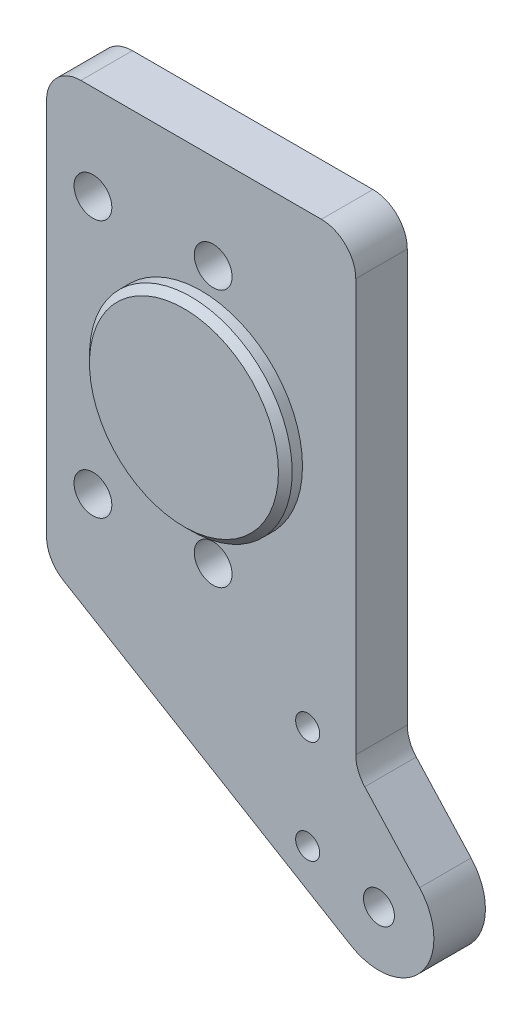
from build123d import *

# Parameters (mm, degrees)
ESQUISSE1_R                     = 29.5
BOSS_EXTRU_1_DEPTH              = 5
BOSS_EXTRU_2_DEPTH              = 15
CHANFREIN1_SIZE                 = 2
ESQUISSE3_R                     = 5.5
ENL_V_MAT_EXTRU_1_DEPTH         = 15
R_P_TITION_LIN_AIRE1_COUNT      = 2
R_P_TITION_LIN_AIRE1_PITCH      = 35
R_P_TITION_LIN_AIRE1_COUNT_DIR2 = 2
R_P_TITION_LIN_AIRE1_PITCH_DIR2 = 75
ESQUISSE4_R                     = 4.5
ENL_V_MAT_EXTRU_2_DEPTH         = 15
ESQUISSE5_R                     = 3.5
ENL_V_MAT_EXTRU_3_DEPTH         = 15
R_P_TITION_LIN_AIRE2_COUNT      = 2
R_P_TITION_LIN_AIRE2_PITCH      = 30
ESQUISSE6_R                     = 29.5
BOSS_EXTRU_3_DEPTH              = 5
CHANFREIN2_SIZE                 = 2
ESQUISSE7_R                     = 29.5
ENL_V_MAT_EXTRU_4_DEPTH         = 5


with BuildPart() as part:
    # Esquisse1 → Boss.-Extru.1 (new body)
    with BuildSketch(Plane.XY):
        Circle(ESQUISSE1_R)
    extrude(amount=BOSS_EXTRU_1_DEPTH)

    # Esquisse2 → Boss.-Extru.2 (add)
    with BuildSketch(Plane.XY.offset(5)):
        with BuildLine():
            Line((47.615285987, -71.742847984), (63.565542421, -89.211443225))
            ThreePointArc((63.565542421, -89.211443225), (64.136880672, -110.127447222), (43.524444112, -113.723710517))
            Line((43.524444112, -113.723710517), (-40.14097243, -63.577319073))
            ThreePointArc((-40.14097243, -63.577319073), (-43.700854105, -59.929009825), (-45, -55))
            Line((-45, -55), (-45, 55))
            ThreePointArc((-45, 55), (-42.071067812, 62.071067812), (-35, 65))
            Line((-35, 65), (35, 65))
            ThreePointArc((35, 65), (42.071067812, 62.071067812), (45, 55))
            Line((45, 55), (45, -65))
            ThreePointArc((45, -65), (45.676718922, -68.616134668), (47.615285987, -71.742847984))
        make_face()
    extrude(amount=BOSS_EXTRU_2_DEPTH)

    # Chanfrein1
    chanfrein1_edges = [part.edges().sort_by_distance(p)[0] for p in [
        (-29.5, 0, 0),
    ]]
    chamfer(chanfrein1_edges, length=CHANFREIN1_SIZE)

    # Esquisse3 → Enl_v. mat.-Extru.1 (cut)
    with BuildSketch(Plane.XY.offset(20)):
        with Locations((-31.5, -37.5)):
            Circle(ESQUISSE3_R)
    enl_v_mat_extru_1 = extrude(amount=-ENL_V_MAT_EXTRU_1_DEPTH, mode=Mode.SUBTRACT)

    # R_p_tition lin_aire1: Enl_v. mat.-Extru.1 2 × 2
    with Locations(*[(i * R_P_TITION_LIN_AIRE1_PITCH, j * R_P_TITION_LIN_AIRE1_PITCH_DIR2, 0) for i in range(R_P_TITION_LIN_AIRE1_COUNT) for j in range(R_P_TITION_LIN_AIRE1_COUNT_DIR2) if (i, j) != (0, 0)]):
        add(enl_v_mat_extru_1, mode=Mode.SUBTRACT)

    # Esquisse4 → Enl_v. mat.-Extru.2 (cut)
    with BuildSketch(Plane.XY.offset(20)):
        with Locations((51.75, -100)):
            Circle(ESQUISSE4_R)
    extrude(amount=-ENL_V_MAT_EXTRU_2_DEPTH, mode=Mode.SUBTRACT)

    # Esquisse5 → Enl_v. mat.-Extru.3 (cut)
    with BuildSketch(Plane.XY.offset(20)):
        with Locations((31, -65)):
            Circle(ESQUISSE5_R)
    enl_v_mat_extru_3 = extrude(amount=-ENL_V_MAT_EXTRU_3_DEPTH, mode=Mode.SUBTRACT)

    # R_p_tition lin_aire2: Enl_v. mat.-Extru.3 ×2
    with Locations(*[(0, -i * R_P_TITION_LIN_AIRE2_PITCH, 0) for i in range(1, R_P_TITION_LIN_AIRE2_COUNT)]):
        add(enl_v_mat_extru_3, mode=Mode.SUBTRACT)

    # Esquisse6 → Boss.-Extru.3 (add)
    with BuildSketch(Plane.XY.offset(20)):
        Circle(ESQUISSE6_R)
    extrude(amount=BOSS_EXTRU_3_DEPTH)

    # Chanfrein2
    chanfrein2_edges = [part.edges().sort_by_distance(p)[0] for p in [
        (-29.5, 0, 25),
    ]]
    chamfer(chanfrein2_edges, length=CHANFREIN2_SIZE)

    # Esquisse7 → Enl_v. mat.-Extru.4 (cut)
    with BuildSketch(Plane(origin=(0, 0, 0), x_dir=(-1, 0, 0), z_dir=(0, 0, -1))):
        with Locations(Location((0, 0, 0), (0, 0, 180))):
            Circle(ESQUISSE7_R)
    extrude(amount=-ENL_V_MAT_EXTRU_4_DEPTH, mode=Mode.SUBTRACT)


solid = part.part
